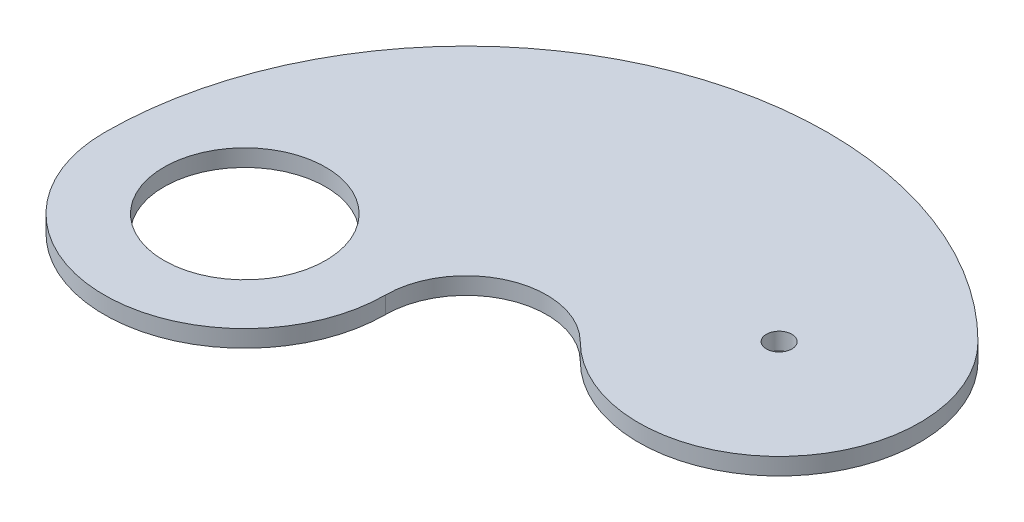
ISO-10303-21;
HEADER;
FILE_DESCRIPTION(('STEP AP214'),'2;1');
FILE_NAME('part.step','',(''),(''),'','','');
FILE_SCHEMA(('AUTOMOTIVE_DESIGN { 1 0 10303 214 1 1 1 1 }'));
ENDSEC;
DATA;
#1=APPLICATION_CONTEXT('core data for automotive mechanical design processes');
#2=APPLICATION_PROTOCOL_DEFINITION('international standard','automotive_design',2000,#1);
#3=PRODUCT_CONTEXT('',#1,'mechanical');
#4=PRODUCT('Part','Part','',(#3));
#5=PRODUCT_RELATED_PRODUCT_CATEGORY('part','',(#4));
#6=PRODUCT_DEFINITION_FORMATION('','',#4);
#7=PRODUCT_DEFINITION_CONTEXT('part definition',#1,'design');
#8=PRODUCT_DEFINITION('design','',#6,#7);
#9=PRODUCT_DEFINITION_SHAPE('','',#8);
#10=(LENGTH_UNIT() NAMED_UNIT(*) SI_UNIT(.MILLI.,.METRE.));
#11=(NAMED_UNIT(*) PLANE_ANGLE_UNIT() SI_UNIT($,.RADIAN.));
#12=(NAMED_UNIT(*) SI_UNIT($,.STERADIAN.) SOLID_ANGLE_UNIT());
#13=UNCERTAINTY_MEASURE_WITH_UNIT(LENGTH_MEASURE(1.E-05),#10,'distance_accuracy_value','');
#14=(GEOMETRIC_REPRESENTATION_CONTEXT(3) GLOBAL_UNCERTAINTY_ASSIGNED_CONTEXT((#13)) GLOBAL_UNIT_ASSIGNED_CONTEXT((#10,
#11,#12)) REPRESENTATION_CONTEXT('',''));
#15=CARTESIAN_POINT('',(0.,0.,0.));
#16=DIRECTION('',(0.,0.,1.));
#17=DIRECTION('',(1.,0.,0.));
#18=AXIS2_PLACEMENT_3D('',#15,#16,#17);
#19=CARTESIAN_POINT('',(0.,6.35,0.));
#20=DIRECTION('',(0.,-1.,0.));
#21=DIRECTION('',(0.,0.,-1.));
#22=AXIS2_PLACEMENT_3D('',#19,#20,#21);
#23=CYLINDRICAL_SURFACE('',#22,135.);
#24=DIRECTION('',(0.,1.,0.));
#25=VECTOR('',#24,1.);
#26=CARTESIAN_POINT('',(95.4594154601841,0.,-95.4594154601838));
#27=LINE('',#26,#25);
#28=CARTESIAN_POINT('',(95.4594154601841,0.,-95.4594154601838));
#29=VERTEX_POINT('',#28);
#30=CARTESIAN_POINT('',(95.4594154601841,6.35,-95.4594154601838));
#31=VERTEX_POINT('',#30);
#32=EDGE_CURVE('E89',#29,#31,#27,.T.);
#33=ORIENTED_EDGE('',*,*,#32,.F.);
#34=CARTESIAN_POINT('',(0.,0.,0.));
#35=DIRECTION('',(0.,1.,0.));
#36=DIRECTION('',(0.,0.,1.));
#37=AXIS2_PLACEMENT_3D('',#34,#35,#36);
#38=CIRCLE('',#37,135.);
#39=CARTESIAN_POINT('',(-135.,0.,0.));
#40=VERTEX_POINT('',#39);
#41=EDGE_CURVE('E52',#29,#40,#38,.T.);
#42=ORIENTED_EDGE('',*,*,#41,.T.);
#43=DIRECTION('',(0.,1.,0.));
#44=VECTOR('',#43,1.);
#45=CARTESIAN_POINT('',(-135.,0.,0.));
#46=LINE('',#45,#44);
#47=CARTESIAN_POINT('',(-135.,6.35,0.));
#48=VERTEX_POINT('',#47);
#49=EDGE_CURVE('E120',#40,#48,#46,.T.);
#50=ORIENTED_EDGE('',*,*,#49,.T.);
#51=CARTESIAN_POINT('',(0.,6.35,0.));
#52=DIRECTION('',(0.,1.,0.));
#53=DIRECTION('',(0.,0.,1.));
#54=AXIS2_PLACEMENT_3D('',#51,#52,#53);
#55=CIRCLE('',#54,135.);
#56=EDGE_CURVE('E12',#31,#48,#55,.T.);
#57=ORIENTED_EDGE('',*,*,#56,.F.);
#58=EDGE_LOOP('',(#33,#42,#50,#57));
#59=FACE_BOUND('',#58,.T.);
#60=ADVANCED_FACE('F49',(#59),#23,.T.);
#61=CARTESIAN_POINT('',(0.,6.35,0.));
#62=DIRECTION('',(0.,1.,0.));
#63=DIRECTION('',(0.,0.,1.));
#64=AXIS2_PLACEMENT_3D('',#61,#62,#63);
#65=PLANE('',#64);
#66=CARTESIAN_POINT('',(58.3716647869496,6.35,-58.3716647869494));
#67=DIRECTION('',(0.,1.,0.));
#68=DIRECTION('',(0.,0.,1.));
#69=AXIS2_PLACEMENT_3D('',#66,#67,#68);
#70=CIRCLE('',#69,4.76249999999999);
#71=CARTESIAN_POINT('',(58.3716647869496,6.35,-53.6091647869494));
#72=VERTEX_POINT('',#71);
#73=EDGE_CURVE('E163',#72,#72,#70,.T.);
#74=ORIENTED_EDGE('',*,*,#73,.F.);
#75=EDGE_LOOP('',(#74));
#76=FACE_BOUND('',#75,.T.);
#77=CARTESIAN_POINT('',(-82.55,6.35,0.));
#78=DIRECTION('',(0.,1.,0.));
#79=DIRECTION('',(0.,0.,1.));
#80=AXIS2_PLACEMENT_3D('',#77,#78,#79);
#81=CIRCLE('',#80,30.1625);
#82=CARTESIAN_POINT('',(-82.55,6.35,30.1625));
#83=VERTEX_POINT('',#82);
#84=EDGE_CURVE('E112',#83,#83,#81,.T.);
#85=ORIENTED_EDGE('',*,*,#84,.F.);
#86=EDGE_LOOP('',(#85));
#87=FACE_BOUND('',#86,.T.);
#88=CARTESIAN_POINT('',(0.,6.35,0.));
#89=DIRECTION('',(0.,1.,0.));
#90=DIRECTION('',(0.,0.,1.));
#91=AXIS2_PLACEMENT_3D('',#88,#89,#90);
#92=CIRCLE('',#91,30.1);
#93=CARTESIAN_POINT('',(21.2839141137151,6.35,-21.2839141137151));
#94=VERTEX_POINT('',#93);
#95=CARTESIAN_POINT('',(-30.1,6.35,0.));
#96=VERTEX_POINT('',#95);
#97=EDGE_CURVE('E109',#94,#96,#92,.T.);
#98=ORIENTED_EDGE('',*,*,#97,.F.);
#99=CARTESIAN_POINT('',(58.3716647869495,6.35,-58.3716647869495));
#100=DIRECTION('',(0.,1.,0.));
#101=DIRECTION('',(0.,0.,1.));
#102=AXIS2_PLACEMENT_3D('',#99,#100,#101);
#103=CIRCLE('',#102,52.45);
#104=EDGE_CURVE('E93',#94,#31,#103,.T.);
#105=ORIENTED_EDGE('',*,*,#104,.T.);
#106=ORIENTED_EDGE('',*,*,#56,.T.);
#107=CARTESIAN_POINT('',(-82.55,6.35,0.));
#108=DIRECTION('',(0.,1.,0.));
#109=DIRECTION('',(0.,0.,1.));
#110=AXIS2_PLACEMENT_3D('',#107,#108,#109);
#111=CIRCLE('',#110,52.45);
#112=EDGE_CURVE('E106',#48,#96,#111,.T.);
#113=ORIENTED_EDGE('',*,*,#112,.T.);
#114=EDGE_LOOP('',(#98,#105,#106,#113));
#115=FACE_BOUND('',#114,.T.);
#116=ADVANCED_FACE('F126',(#76,#87,#115),#65,.T.);
#117=CARTESIAN_POINT('',(0.,0.,0.));
#118=DIRECTION('',(0.,1.,0.));
#119=DIRECTION('',(0.,0.,1.));
#120=AXIS2_PLACEMENT_3D('',#117,#118,#119);
#121=PLANE('',#120);
#122=CARTESIAN_POINT('',(58.3716647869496,0.,-58.3716647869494));
#123=DIRECTION('',(0.,1.,0.));
#124=DIRECTION('',(0.,0.,1.));
#125=AXIS2_PLACEMENT_3D('',#122,#123,#124);
#126=CIRCLE('',#125,4.76249999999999);
#127=CARTESIAN_POINT('',(58.3716647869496,0.,-53.6091647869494));
#128=VERTEX_POINT('',#127);
#129=EDGE_CURVE('E161',#128,#128,#126,.T.);
#130=ORIENTED_EDGE('',*,*,#129,.T.);
#131=EDGE_LOOP('',(#130));
#132=FACE_BOUND('',#131,.T.);
#133=CARTESIAN_POINT('',(-82.55,0.,0.));
#134=DIRECTION('',(0.,1.,0.));
#135=DIRECTION('',(0.,0.,1.));
#136=AXIS2_PLACEMENT_3D('',#133,#134,#135);
#137=CIRCLE('',#136,30.1625);
#138=CARTESIAN_POINT('',(-82.55,0.,30.1625));
#139=VERTEX_POINT('',#138);
#140=EDGE_CURVE('E117',#139,#139,#137,.T.);
#141=ORIENTED_EDGE('',*,*,#140,.T.);
#142=EDGE_LOOP('',(#141));
#143=FACE_BOUND('',#142,.T.);
#144=CARTESIAN_POINT('',(58.3716647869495,0.,-58.3716647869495));
#145=DIRECTION('',(0.,1.,0.));
#146=DIRECTION('',(0.,0.,1.));
#147=AXIS2_PLACEMENT_3D('',#144,#145,#146);
#148=CIRCLE('',#147,52.45);
#149=CARTESIAN_POINT('',(21.2839141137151,0.,-21.2839141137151));
#150=VERTEX_POINT('',#149);
#151=EDGE_CURVE('E73',#150,#29,#148,.T.);
#152=ORIENTED_EDGE('',*,*,#151,.F.);
#153=CARTESIAN_POINT('',(0.,0.,0.));
#154=DIRECTION('',(0.,1.,0.));
#155=DIRECTION('',(0.,0.,1.));
#156=AXIS2_PLACEMENT_3D('',#153,#154,#155);
#157=CIRCLE('',#156,30.1);
#158=CARTESIAN_POINT('',(-30.1,0.,0.));
#159=VERTEX_POINT('',#158);
#160=EDGE_CURVE('E98',#150,#159,#157,.T.);
#161=ORIENTED_EDGE('',*,*,#160,.T.);
#162=CARTESIAN_POINT('',(-82.55,0.,0.));
#163=DIRECTION('',(0.,1.,0.));
#164=DIRECTION('',(0.,0.,1.));
#165=AXIS2_PLACEMENT_3D('',#162,#163,#164);
#166=CIRCLE('',#165,52.45);
#167=EDGE_CURVE('E95',#40,#159,#166,.T.);
#168=ORIENTED_EDGE('',*,*,#167,.F.);
#169=ORIENTED_EDGE('',*,*,#41,.F.);
#170=EDGE_LOOP('',(#152,#161,#168,#169));
#171=FACE_BOUND('',#170,.T.);
#172=ADVANCED_FACE('F104',(#132,#143,#171),#121,.F.);
#173=CARTESIAN_POINT('',(58.3716647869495,0.,-58.3716647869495));
#174=DIRECTION('',(0.,1.,0.));
#175=DIRECTION('',(0.,0.,1.));
#176=AXIS2_PLACEMENT_3D('',#173,#174,#175);
#177=CYLINDRICAL_SURFACE('',#176,52.45);
#178=ORIENTED_EDGE('',*,*,#104,.F.);
#179=DIRECTION('',(0.,1.,0.));
#180=VECTOR('',#179,1.);
#181=CARTESIAN_POINT('',(21.2839141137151,0.,-21.2839141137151));
#182=LINE('',#181,#180);
#183=EDGE_CURVE('E91',#150,#94,#182,.T.);
#184=ORIENTED_EDGE('',*,*,#183,.F.);
#185=ORIENTED_EDGE('',*,*,#151,.T.);
#186=ORIENTED_EDGE('',*,*,#32,.T.);
#187=EDGE_LOOP('',(#178,#184,#185,#186));
#188=FACE_BOUND('',#187,.T.);
#189=ADVANCED_FACE('F92',(#188),#177,.T.);
#190=CARTESIAN_POINT('',(-82.55,0.,0.));
#191=DIRECTION('',(0.,1.,0.));
#192=DIRECTION('',(0.,0.,1.));
#193=AXIS2_PLACEMENT_3D('',#190,#191,#192);
#194=CYLINDRICAL_SURFACE('',#193,52.45);
#195=ORIENTED_EDGE('',*,*,#112,.F.);
#196=ORIENTED_EDGE('',*,*,#49,.F.);
#197=ORIENTED_EDGE('',*,*,#167,.T.);
#198=DIRECTION('',(0.,1.,0.));
#199=VECTOR('',#198,1.);
#200=CARTESIAN_POINT('',(-30.1,0.,0.));
#201=LINE('',#200,#199);
#202=EDGE_CURVE('E64',#159,#96,#201,.T.);
#203=ORIENTED_EDGE('',*,*,#202,.T.);
#204=EDGE_LOOP('',(#195,#196,#197,#203));
#205=FACE_BOUND('',#204,.T.);
#206=ADVANCED_FACE('F124',(#205),#194,.T.);
#207=CARTESIAN_POINT('',(0.,0.,0.));
#208=DIRECTION('',(0.,1.,0.));
#209=DIRECTION('',(0.,0.,1.));
#210=AXIS2_PLACEMENT_3D('',#207,#208,#209);
#211=CYLINDRICAL_SURFACE('',#210,30.1);
#212=ORIENTED_EDGE('',*,*,#97,.T.);
#213=ORIENTED_EDGE('',*,*,#202,.F.);
#214=ORIENTED_EDGE('',*,*,#160,.F.);
#215=ORIENTED_EDGE('',*,*,#183,.T.);
#216=EDGE_LOOP('',(#212,#213,#214,#215));
#217=FACE_BOUND('',#216,.T.);
#218=ADVANCED_FACE('F99',(#217),#211,.F.);
#219=CARTESIAN_POINT('',(-82.55,0.,0.));
#220=DIRECTION('',(0.,1.,0.));
#221=DIRECTION('',(0.,0.,1.));
#222=AXIS2_PLACEMENT_3D('',#219,#220,#221);
#223=CYLINDRICAL_SURFACE('',#222,30.1625);
#224=ORIENTED_EDGE('',*,*,#140,.F.);
#225=EDGE_LOOP('',(#224));
#226=FACE_BOUND('',#225,.T.);
#227=ORIENTED_EDGE('',*,*,#84,.T.);
#228=EDGE_LOOP('',(#227));
#229=FACE_BOUND('',#228,.T.);
#230=ADVANCED_FACE('F147',(#226,#229),#223,.F.);
#231=CARTESIAN_POINT('',(58.3716647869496,0.,-58.3716647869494));
#232=DIRECTION('',(0.,1.,0.));
#233=DIRECTION('',(0.,0.,1.));
#234=AXIS2_PLACEMENT_3D('',#231,#232,#233);
#235=CYLINDRICAL_SURFACE('',#234,4.76249999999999);
#236=ORIENTED_EDGE('',*,*,#129,.F.);
#237=EDGE_LOOP('',(#236));
#238=FACE_BOUND('',#237,.T.);
#239=ORIENTED_EDGE('',*,*,#73,.T.);
#240=EDGE_LOOP('',(#239));
#241=FACE_BOUND('',#240,.T.);
#242=ADVANCED_FACE('F152',(#238,#241),#235,.F.);
#243=CLOSED_SHELL('',(#60,#116,#172,#189,#206,#218,#230,#242));
#244=MANIFOLD_SOLID_BREP('B2',#243);
#245=ADVANCED_BREP_SHAPE_REPRESENTATION('',(#18,#244),#14);
#246=SHAPE_DEFINITION_REPRESENTATION(#9,#245);
ENDSEC;
END-ISO-10303-21;
